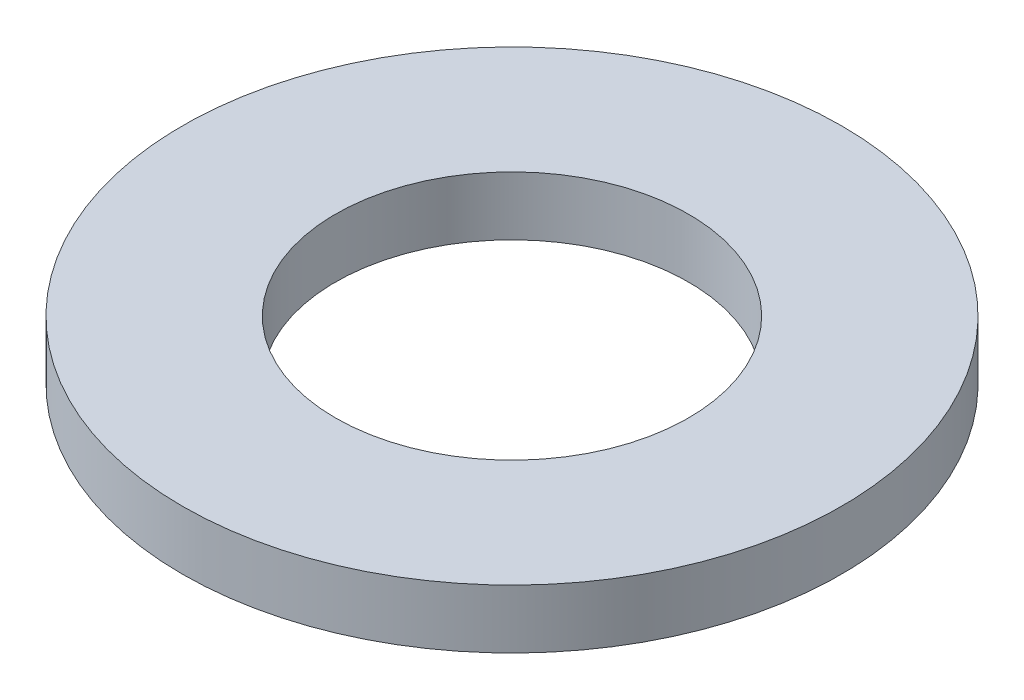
ISO-10303-21;
HEADER;
FILE_DESCRIPTION(('STEP AP214'),'2;1');
FILE_NAME('part.step','',(''),(''),'','','');
FILE_SCHEMA(('AUTOMOTIVE_DESIGN { 1 0 10303 214 1 1 1 1 }'));
ENDSEC;
DATA;
#1=APPLICATION_CONTEXT('core data for automotive mechanical design processes');
#2=APPLICATION_PROTOCOL_DEFINITION('international standard','automotive_design',2000,#1);
#3=PRODUCT_CONTEXT('',#1,'mechanical');
#4=PRODUCT('Part','Part','',(#3));
#5=PRODUCT_RELATED_PRODUCT_CATEGORY('part','',(#4));
#6=PRODUCT_DEFINITION_FORMATION('','',#4);
#7=PRODUCT_DEFINITION_CONTEXT('part definition',#1,'design');
#8=PRODUCT_DEFINITION('design','',#6,#7);
#9=PRODUCT_DEFINITION_SHAPE('','',#8);
#10=(LENGTH_UNIT() NAMED_UNIT(*) SI_UNIT(.MILLI.,.METRE.));
#11=(NAMED_UNIT(*) PLANE_ANGLE_UNIT() SI_UNIT($,.RADIAN.));
#12=(NAMED_UNIT(*) SI_UNIT($,.STERADIAN.) SOLID_ANGLE_UNIT());
#13=UNCERTAINTY_MEASURE_WITH_UNIT(LENGTH_MEASURE(1.E-05),#10,'distance_accuracy_value','');
#14=(GEOMETRIC_REPRESENTATION_CONTEXT(3) GLOBAL_UNCERTAINTY_ASSIGNED_CONTEXT((#13)) GLOBAL_UNIT_ASSIGNED_CONTEXT((#10,
#11,#12)) REPRESENTATION_CONTEXT('',''));
#15=CARTESIAN_POINT('',(0.,0.,0.));
#16=DIRECTION('',(0.,0.,1.));
#17=DIRECTION('',(1.,0.,0.));
#18=AXIS2_PLACEMENT_3D('',#15,#16,#17);
#19=CARTESIAN_POINT('',(0.,2.5,0.));
#20=DIRECTION('',(0.,1.,0.));
#21=DIRECTION('',(0.,0.,1.));
#22=AXIS2_PLACEMENT_3D('',#19,#20,#21);
#23=PLANE('',#22);
#24=CARTESIAN_POINT('',(0.,2.5,0.));
#25=DIRECTION('',(0.,1.,0.));
#26=DIRECTION('',(0.,0.,1.));
#27=AXIS2_PLACEMENT_3D('',#24,#25,#26);
#28=CIRCLE('',#27,14.);
#29=CARTESIAN_POINT('',(0.,2.5,14.));
#30=VERTEX_POINT('',#29);
#31=EDGE_CURVE('E10',#30,#30,#28,.T.);
#32=ORIENTED_EDGE('',*,*,#31,.T.);
#33=EDGE_LOOP('',(#32));
#34=FACE_BOUND('',#33,.T.);
#35=CARTESIAN_POINT('',(0.,2.5,0.));
#36=DIRECTION('',(0.,1.,0.));
#37=DIRECTION('',(0.,0.,1.));
#38=AXIS2_PLACEMENT_3D('',#35,#36,#37);
#39=CIRCLE('',#38,7.5);
#40=CARTESIAN_POINT('',(0.,2.5,7.5));
#41=VERTEX_POINT('',#40);
#42=EDGE_CURVE('E39',#41,#41,#39,.T.);
#43=ORIENTED_EDGE('',*,*,#42,.F.);
#44=EDGE_LOOP('',(#43));
#45=FACE_BOUND('',#44,.T.);
#46=ADVANCED_FACE('F28',(#34,#45),#23,.T.);
#47=CARTESIAN_POINT('',(0.,0.,0.));
#48=DIRECTION('',(0.,1.,0.));
#49=DIRECTION('',(0.,0.,1.));
#50=AXIS2_PLACEMENT_3D('',#47,#48,#49);
#51=PLANE('',#50);
#52=CARTESIAN_POINT('',(0.,0.,0.));
#53=DIRECTION('',(0.,1.,0.));
#54=DIRECTION('',(0.,0.,1.));
#55=AXIS2_PLACEMENT_3D('',#52,#53,#54);
#56=CIRCLE('',#55,14.);
#57=CARTESIAN_POINT('',(0.,0.,14.));
#58=VERTEX_POINT('',#57);
#59=EDGE_CURVE('E35',#58,#58,#56,.T.);
#60=ORIENTED_EDGE('',*,*,#59,.F.);
#61=EDGE_LOOP('',(#60));
#62=FACE_BOUND('',#61,.T.);
#63=CARTESIAN_POINT('',(0.,0.,0.));
#64=DIRECTION('',(0.,1.,0.));
#65=DIRECTION('',(0.,0.,1.));
#66=AXIS2_PLACEMENT_3D('',#63,#64,#65);
#67=CIRCLE('',#66,7.5);
#68=CARTESIAN_POINT('',(0.,0.,7.5));
#69=VERTEX_POINT('',#68);
#70=EDGE_CURVE('E43',#69,#69,#67,.T.);
#71=ORIENTED_EDGE('',*,*,#70,.T.);
#72=EDGE_LOOP('',(#71));
#73=FACE_BOUND('',#72,.T.);
#74=ADVANCED_FACE('F49',(#62,#73),#51,.F.);
#75=CARTESIAN_POINT('',(0.,2.5,0.));
#76=DIRECTION('',(0.,-1.,0.));
#77=DIRECTION('',(0.,0.,-1.));
#78=AXIS2_PLACEMENT_3D('',#75,#76,#77);
#79=CYLINDRICAL_SURFACE('',#78,14.);
#80=ORIENTED_EDGE('',*,*,#31,.F.);
#81=EDGE_LOOP('',(#80));
#82=FACE_BOUND('',#81,.T.);
#83=ORIENTED_EDGE('',*,*,#59,.T.);
#84=EDGE_LOOP('',(#83));
#85=FACE_BOUND('',#84,.T.);
#86=ADVANCED_FACE('F30',(#82,#85),#79,.T.);
#87=CARTESIAN_POINT('',(0.,2.5,0.));
#88=DIRECTION('',(0.,-1.,0.));
#89=DIRECTION('',(0.,0.,-1.));
#90=AXIS2_PLACEMENT_3D('',#87,#88,#89);
#91=CYLINDRICAL_SURFACE('',#90,7.5);
#92=ORIENTED_EDGE('',*,*,#42,.T.);
#93=EDGE_LOOP('',(#92));
#94=FACE_BOUND('',#93,.T.);
#95=ORIENTED_EDGE('',*,*,#70,.F.);
#96=EDGE_LOOP('',(#95));
#97=FACE_BOUND('',#96,.T.);
#98=ADVANCED_FACE('F51',(#94,#97),#91,.F.);
#99=CLOSED_SHELL('',(#46,#74,#86,#98));
#100=MANIFOLD_SOLID_BREP('B2',#99);
#101=ADVANCED_BREP_SHAPE_REPRESENTATION('',(#18,#100),#14);
#102=SHAPE_DEFINITION_REPRESENTATION(#9,#101);
ENDSEC;
END-ISO-10303-21;
